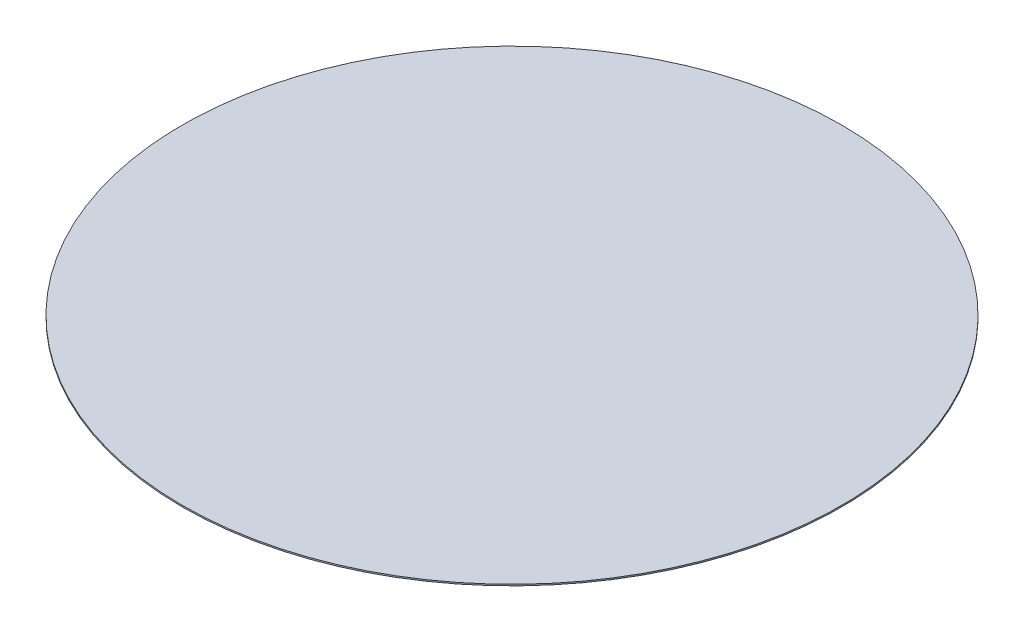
ISO-10303-21;
HEADER;
FILE_DESCRIPTION(('STEP AP214'),'2;1');
FILE_NAME('part.step','',(''),(''),'','','');
FILE_SCHEMA(('AUTOMOTIVE_DESIGN { 1 0 10303 214 1 1 1 1 }'));
ENDSEC;
DATA;
#1=APPLICATION_CONTEXT('core data for automotive mechanical design processes');
#2=APPLICATION_PROTOCOL_DEFINITION('international standard','automotive_design',2000,#1);
#3=PRODUCT_CONTEXT('',#1,'mechanical');
#4=PRODUCT('Part','Part','',(#3));
#5=PRODUCT_RELATED_PRODUCT_CATEGORY('part','',(#4));
#6=PRODUCT_DEFINITION_FORMATION('','',#4);
#7=PRODUCT_DEFINITION_CONTEXT('part definition',#1,'design');
#8=PRODUCT_DEFINITION('design','',#6,#7);
#9=PRODUCT_DEFINITION_SHAPE('','',#8);
#10=(LENGTH_UNIT() NAMED_UNIT(*) SI_UNIT(.MILLI.,.METRE.));
#11=(NAMED_UNIT(*) PLANE_ANGLE_UNIT() SI_UNIT($,.RADIAN.));
#12=(NAMED_UNIT(*) SI_UNIT($,.STERADIAN.) SOLID_ANGLE_UNIT());
#13=UNCERTAINTY_MEASURE_WITH_UNIT(LENGTH_MEASURE(1.E-05),#10,'distance_accuracy_value','');
#14=(GEOMETRIC_REPRESENTATION_CONTEXT(3) GLOBAL_UNCERTAINTY_ASSIGNED_CONTEXT((#13)) GLOBAL_UNIT_ASSIGNED_CONTEXT((#10,
#11,#12)) REPRESENTATION_CONTEXT('',''));
#15=CARTESIAN_POINT('',(0.,0.,0.));
#16=DIRECTION('',(0.,0.,1.));
#17=DIRECTION('',(1.,0.,0.));
#18=AXIS2_PLACEMENT_3D('',#15,#16,#17);
#19=CARTESIAN_POINT('',(0.,0.1,0.));
#20=DIRECTION('',(0.,-1.,0.));
#21=DIRECTION('',(0.,0.,-1.));
#22=AXIS2_PLACEMENT_3D('',#19,#20,#21);
#23=CYLINDRICAL_SURFACE('',#22,23.5);
#24=CARTESIAN_POINT('',(0.,0.1,0.));
#25=DIRECTION('',(0.,1.,0.));
#26=DIRECTION('',(0.,0.,1.));
#27=AXIS2_PLACEMENT_3D('',#24,#25,#26);
#28=CIRCLE('',#27,23.5);
#29=CARTESIAN_POINT('',(0.,0.1,23.5));
#30=VERTEX_POINT('',#29);
#31=EDGE_CURVE('E10',#30,#30,#28,.T.);
#32=ORIENTED_EDGE('',*,*,#31,.F.);
#33=EDGE_LOOP('',(#32));
#34=FACE_BOUND('',#33,.T.);
#35=CARTESIAN_POINT('',(0.,0.,0.));
#36=DIRECTION('',(0.,1.,0.));
#37=DIRECTION('',(0.,0.,1.));
#38=AXIS2_PLACEMENT_3D('',#35,#36,#37);
#39=CIRCLE('',#38,23.5);
#40=CARTESIAN_POINT('',(0.,0.,23.5));
#41=VERTEX_POINT('',#40);
#42=EDGE_CURVE('E42',#41,#41,#39,.T.);
#43=ORIENTED_EDGE('',*,*,#42,.T.);
#44=EDGE_LOOP('',(#43));
#45=FACE_BOUND('',#44,.T.);
#46=ADVANCED_FACE('F39',(#34,#45),#23,.T.);
#47=CARTESIAN_POINT('',(0.,0.1,0.));
#48=DIRECTION('',(0.,1.,0.));
#49=DIRECTION('',(0.,0.,1.));
#50=AXIS2_PLACEMENT_3D('',#47,#48,#49);
#51=PLANE('',#50);
#52=ORIENTED_EDGE('',*,*,#31,.T.);
#53=EDGE_LOOP('',(#52));
#54=FACE_BOUND('',#53,.T.);
#55=ADVANCED_FACE('F54',(#54),#51,.T.);
#56=CARTESIAN_POINT('',(0.,0.,0.));
#57=DIRECTION('',(0.,1.,0.));
#58=DIRECTION('',(0.,0.,1.));
#59=AXIS2_PLACEMENT_3D('',#56,#57,#58);
#60=PLANE('',#59);
#61=ORIENTED_EDGE('',*,*,#42,.F.);
#62=EDGE_LOOP('',(#61));
#63=FACE_BOUND('',#62,.T.);
#64=ADVANCED_FACE('F52',(#63),#60,.F.);
#65=CLOSED_SHELL('',(#46,#55,#64));
#66=MANIFOLD_SOLID_BREP('B2',#65);
#67=ADVANCED_BREP_SHAPE_REPRESENTATION('',(#18,#66),#14);
#68=SHAPE_DEFINITION_REPRESENTATION(#9,#67);
ENDSEC;
END-ISO-10303-21;
